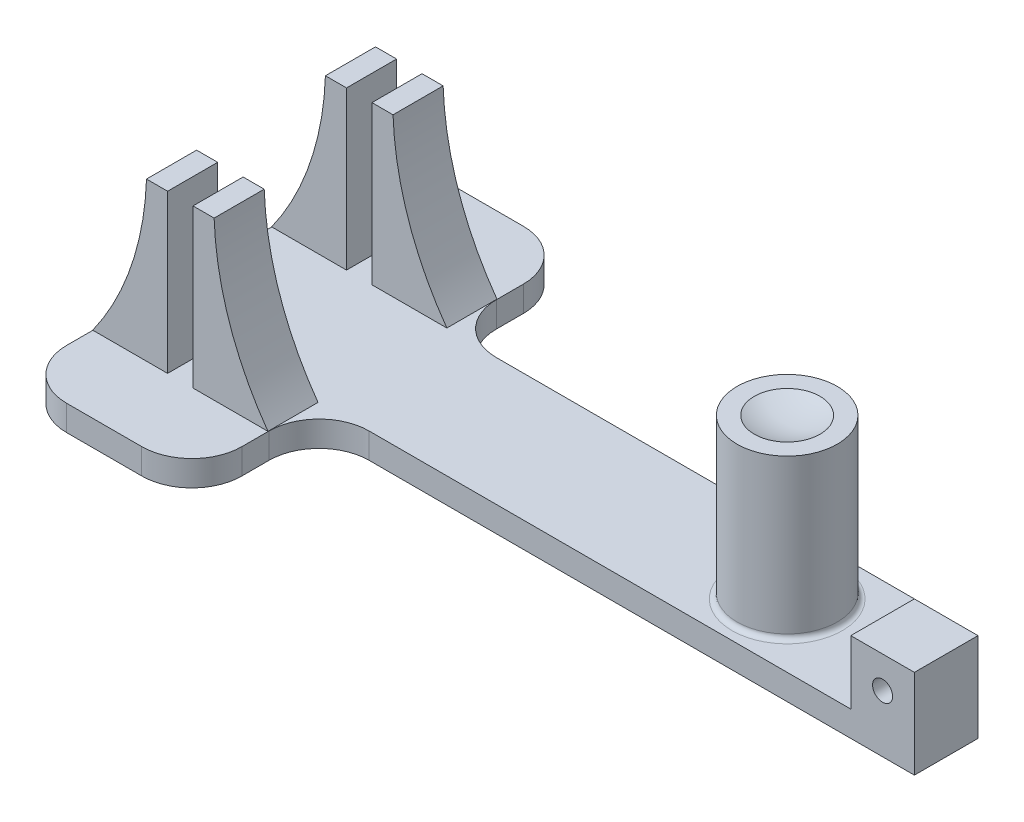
from build123d import *

# Parameters (mm, degrees)
BOSS_EXTRUDE1_DEPTH = 5.08
BOSS_EXTRUDE2_DEPTH = 10
SKETCH3_R           = 10
BOSS_EXTRUDE3_DEPTH = 31.75
FILLET1_R           = 1
SKETCH5_W           = 12.7
SKETCH5_H           = 12.7
BOSS_EXTRUDE4_DEPTH = 12.7
SKETCH7_R           = 2
CUT_EXTRUDE1_DEPTH  = 12.7


with BuildPart() as part:
    # Sketch1 → Boss-Extrude1 (new body)
    with BuildSketch(Plane(origin=(0, 0, 0), x_dir=(1, 0, 0), z_dir=(0, 1, 0))):
        with BuildLine():
            Line((20.08, 28.1), (20.08, 22.7))
            ThreePointArc((20.08, 22.7), (23.008932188, 15.628932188), (30.08, 12.7))
            Line((30.08, 12.7), (126.24, 12.7))
            Line((126.24, 12.7), (126.24, 0))
            Line((126.24, 0), (138.94, 0))
            Line((138.94, 0), (138.94, -12.7))
            Line((138.94, -12.7), (126.24, -12.7))
            Line((126.24, -12.7), (30.08, -12.7))
            ThreePointArc((30.08, -12.7), (23.008932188, -15.628932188), (20.08, -22.7))
            Line((20.08, -22.7), (20.08, -28.1))
            ThreePointArc((20.08, -28.1), (17.151067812, -35.171067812), (10.08, -38.1))
            Line((10.08, -38.1), (-4.92, -38.1))
            ThreePointArc((-4.92, -38.1), (-11.991067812, -35.171067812), (-14.92, -28.1))
            Line((-14.92, -28.1), (-14.92, 28.1))
            ThreePointArc((-14.92, 28.1), (-11.991067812, 35.171067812), (-4.92, 38.1))
            Line((-4.92, 38.1), (10.08, 38.1))
            ThreePointArc((10.08, 38.1), (17.151067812, 35.171067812), (20.08, 28.1))
        make_face()
    extrude(amount=-BOSS_EXTRUDE1_DEPTH)

    # Sketch2 → Boss-Extrude2 (add)
    with BuildSketch(Plane.XY.offset(22.86)):
        with BuildLine():
            Line((0, 0), (-14.953299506, 0))
            ThreePointArc((-14.953299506, 0), (-7.255141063, 14.95657571), (-4.209502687, 31.5))
            Line((-4.209502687, 31.5), (0, 31.5))
            Line((0, 31.5), (0, 0))
        make_face()
        with BuildLine():
            Line((5.08, 0), (20.033299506, 0))
            ThreePointArc((20.033299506, 0), (12.335141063, 14.95657571), (9.289502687, 31.5))
            Line((9.289502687, 31.5), (5.08, 31.5))
            Line((5.08, 31.5), (5.08, 0))
        make_face()
    boss_extrude2 = extrude(amount=-BOSS_EXTRUDE2_DEPTH)

    # Mirror1: Boss-Extrude2 across plane
    add(boss_extrude2.mirror(Plane.XY))

    # Sketch3 → Boss-Extrude3 (add)
    with BuildSketch(Plane(origin=(0, 0, 0), x_dir=(1, 0, 0), z_dir=(0, 1, 0))):
        with Locations(Location((100.84, 0, 0), (0, 0, 270))):
            Circle(SKETCH3_R)
    extrude(amount=BOSS_EXTRUDE3_DEPTH)

    # Fillet1
    fillet1_edges = [part.edges().sort_by_distance(p)[0] for p in [
        (100.84, 0, -10),
    ]]
    fillet(fillet1_edges, radius=FILLET1_R)

    # Sketch4 → Cut-Revolve1 (revolve, cut)
    with BuildSketch(Plane.XY):
        with BuildLine():
            Line((100.84, 31.75), (107.399510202, 31.75))
            ThreePointArc((107.399510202, 31.75), (104.189414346, 30.733638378), (100.84, 30.3884864))
            Line((100.84, 30.3884864), (100.84, 31.75))
        make_face()
    revolve(axis=Axis((100.84, 31.75, 0), (0, -1, 0)), mode=Mode.SUBTRACT)

    # Sketch5 → Boss-Extrude4 (add)
    with BuildSketch(Plane(origin=(0, 0, 0), x_dir=(1, 0, 0), z_dir=(0, 1, 0))):
        with Locations((132.59, -6.35)):
            Rectangle(SKETCH5_W, SKETCH5_H)
    extrude(amount=BOSS_EXTRUDE4_DEPTH)

    # Sketch7 → Cut-Extrude1 (cut)
    with BuildSketch(Plane.XY):
        with Locations((132.59, 6.35)):
            Circle(SKETCH7_R)
    extrude(amount=CUT_EXTRUDE1_DEPTH, mode=Mode.SUBTRACT)


solid = part.part
